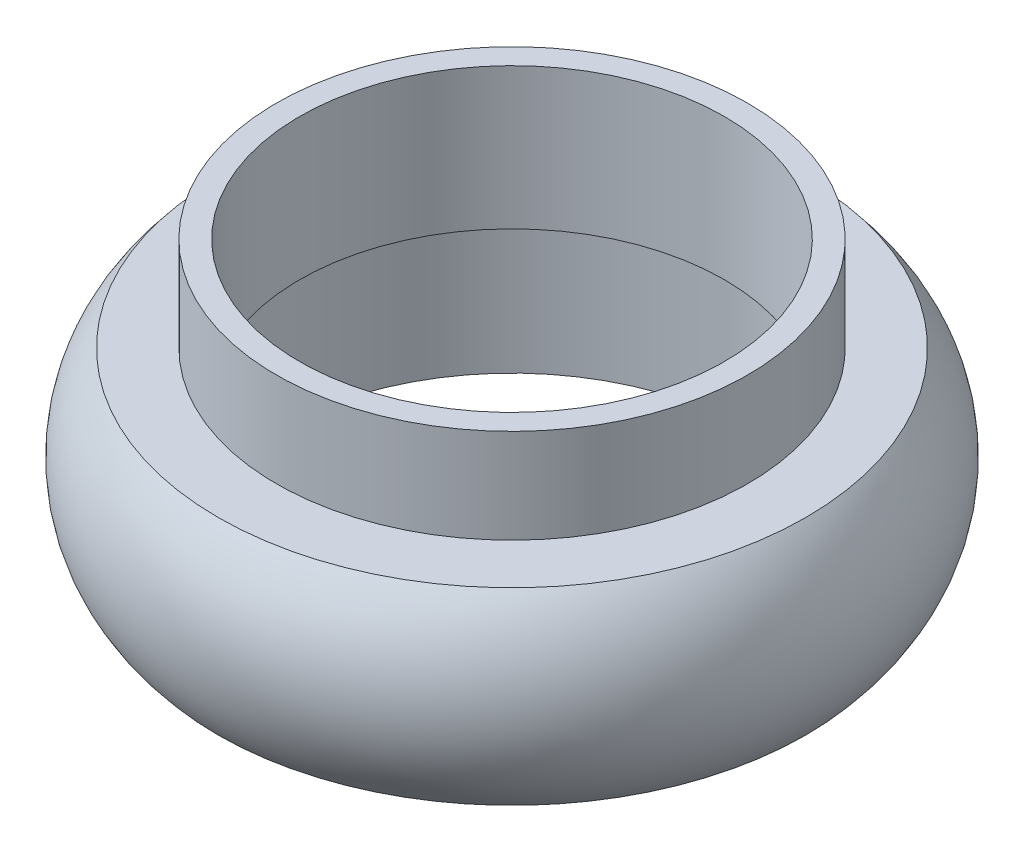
from build123d import *


with BuildPart() as part:
    # Sketch1 → Revolve1 (revolve)
    with BuildSketch(Plane.XY, mode=Mode.PRIVATE) as revolve1_sk:
        with BuildLine():
            Line((14.311628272, 9.525), (14.311628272, 19.05))
            Line((14.311628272, 19.05), (15.875, 19.05))
            Line((15.875, 19.05), (15.875, 12.7))
            Line((15.875, 12.7), (19.799515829, 12.7))
            ThreePointArc((19.799515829, 12.7), (22.225, 6.35), (19.799515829, 0))
            Line((19.799515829, 0), (15.875, 0))
            Line((15.875, 0), (15.875, 9.525))
            Line((15.875, 9.525), (14.311628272, 9.525))
        make_face()
    revolve(revolve1_sk.sketch.rotate(Axis((0, 0, 0), (0, 1, 0)), 90), axis=Axis((0, 0, 0), (0, 1, 0)))


solid = part.part
